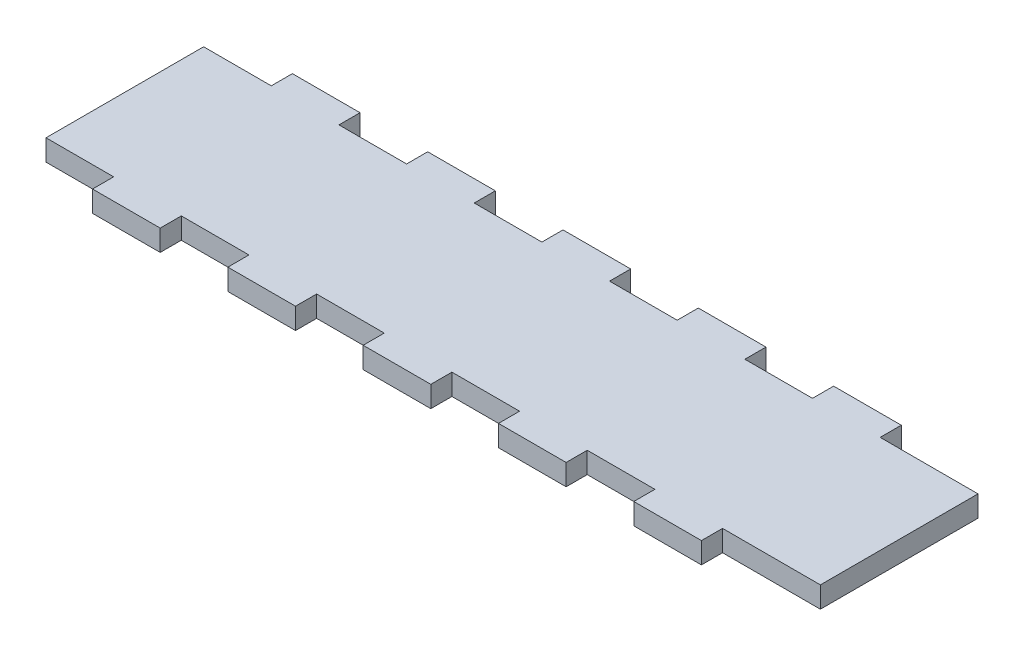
ISO-10303-21;
HEADER;
FILE_DESCRIPTION(('STEP AP214'),'2;1');
FILE_NAME('part.step','',(''),(''),'','','');
FILE_SCHEMA(('AUTOMOTIVE_DESIGN { 1 0 10303 214 1 1 1 1 }'));
ENDSEC;
DATA;
#1=APPLICATION_CONTEXT('core data for automotive mechanical design processes');
#2=APPLICATION_PROTOCOL_DEFINITION('international standard','automotive_design',2000,#1);
#3=PRODUCT_CONTEXT('',#1,'mechanical');
#4=PRODUCT('Part','Part','',(#3));
#5=PRODUCT_RELATED_PRODUCT_CATEGORY('part','',(#4));
#6=PRODUCT_DEFINITION_FORMATION('','',#4);
#7=PRODUCT_DEFINITION_CONTEXT('part definition',#1,'design');
#8=PRODUCT_DEFINITION('design','',#6,#7);
#9=PRODUCT_DEFINITION_SHAPE('','',#8);
#10=(LENGTH_UNIT() NAMED_UNIT(*) SI_UNIT(.MILLI.,.METRE.));
#11=(NAMED_UNIT(*) PLANE_ANGLE_UNIT() SI_UNIT($,.RADIAN.));
#12=(NAMED_UNIT(*) SI_UNIT($,.STERADIAN.) SOLID_ANGLE_UNIT());
#13=UNCERTAINTY_MEASURE_WITH_UNIT(LENGTH_MEASURE(1.E-05),#10,'distance_accuracy_value','');
#14=(GEOMETRIC_REPRESENTATION_CONTEXT(3) GLOBAL_UNCERTAINTY_ASSIGNED_CONTEXT((#13)) GLOBAL_UNIT_ASSIGNED_CONTEXT((#10,
#11,#12)) REPRESENTATION_CONTEXT('',''));
#15=CARTESIAN_POINT('',(0.,0.,0.));
#16=DIRECTION('',(0.,0.,1.));
#17=DIRECTION('',(1.,0.,0.));
#18=AXIS2_PLACEMENT_3D('',#15,#16,#17);
#19=CARTESIAN_POINT('',(59.,3.38,0.));
#20=DIRECTION('',(1.,0.,0.));
#21=DIRECTION('',(0.,0.,-1.));
#22=AXIS2_PLACEMENT_3D('',#19,#20,#21);
#23=PLANE('',#22);
#24=DIRECTION('',(0.,0.,1.));
#25=VECTOR('',#24,1.);
#26=CARTESIAN_POINT('',(59.,0.,0.));
#27=LINE('',#26,#25);
#28=CARTESIAN_POINT('',(59.,0.,-12.62));
#29=VERTEX_POINT('',#28);
#30=CARTESIAN_POINT('',(59.,0.,12.62));
#31=VERTEX_POINT('',#30);
#32=EDGE_CURVE('E348',#29,#31,#27,.T.);
#33=ORIENTED_EDGE('',*,*,#32,.F.);
#34=DIRECTION('',(0.,-1.,0.));
#35=VECTOR('',#34,1.);
#36=CARTESIAN_POINT('',(59.,3.38,-12.62));
#37=LINE('',#36,#35);
#38=CARTESIAN_POINT('',(59.,3.38,-12.62));
#39=VERTEX_POINT('',#38);
#40=EDGE_CURVE('E11',#39,#29,#37,.T.);
#41=ORIENTED_EDGE('',*,*,#40,.F.);
#42=DIRECTION('',(0.,0.,1.));
#43=VECTOR('',#42,1.);
#44=CARTESIAN_POINT('',(59.,3.38,0.));
#45=LINE('',#44,#43);
#46=CARTESIAN_POINT('',(59.,3.38,12.62));
#47=VERTEX_POINT('',#46);
#48=EDGE_CURVE('E444',#39,#47,#45,.T.);
#49=ORIENTED_EDGE('',*,*,#48,.T.);
#50=DIRECTION('',(0.,-1.,0.));
#51=VECTOR('',#50,1.);
#52=CARTESIAN_POINT('',(59.,3.38,12.62));
#53=LINE('',#52,#51);
#54=EDGE_CURVE('E196',#47,#31,#53,.T.);
#55=ORIENTED_EDGE('',*,*,#54,.T.);
#56=EDGE_LOOP('',(#33,#41,#49,#55));
#57=FACE_BOUND('',#56,.T.);
#58=ADVANCED_FACE('F37',(#57),#23,.T.);
#59=CARTESIAN_POINT('',(0.,3.38,-12.62));
#60=DIRECTION('',(0.,0.,-1.));
#61=DIRECTION('',(-1.,0.,0.));
#62=AXIS2_PLACEMENT_3D('',#59,#60,#61);
#63=PLANE('',#62);
#64=DIRECTION('',(1.,0.,0.));
#65=VECTOR('',#64,1.);
#66=CARTESIAN_POINT('',(0.,0.,-12.62));
#67=LINE('',#66,#65);
#68=CARTESIAN_POINT('',(43.3333333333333,0.,-12.62));
#69=VERTEX_POINT('',#68);
#70=EDGE_CURVE('E351',#69,#29,#67,.T.);
#71=ORIENTED_EDGE('',*,*,#70,.F.);
#72=DIRECTION('',(0.,-1.,0.));
#73=VECTOR('',#72,1.);
#74=CARTESIAN_POINT('',(43.3333333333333,3.38,-12.62));
#75=LINE('',#74,#73);
#76=CARTESIAN_POINT('',(43.3333333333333,3.38,-12.62));
#77=VERTEX_POINT('',#76);
#78=EDGE_CURVE('E45',#77,#69,#75,.T.);
#79=ORIENTED_EDGE('',*,*,#78,.F.);
#80=DIRECTION('',(1.,0.,0.));
#81=VECTOR('',#80,1.);
#82=CARTESIAN_POINT('',(0.,3.38,-12.62));
#83=LINE('',#82,#81);
#84=EDGE_CURVE('E563',#77,#39,#83,.T.);
#85=ORIENTED_EDGE('',*,*,#84,.T.);
#86=ORIENTED_EDGE('',*,*,#40,.T.);
#87=EDGE_LOOP('',(#71,#79,#85,#86));
#88=FACE_BOUND('',#87,.T.);
#89=ADVANCED_FACE('F551',(#88),#63,.T.);
#90=CARTESIAN_POINT('',(43.3333333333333,3.38,0.));
#91=DIRECTION('',(1.,0.,0.));
#92=DIRECTION('',(0.,0.,-1.));
#93=AXIS2_PLACEMENT_3D('',#90,#91,#92);
#94=PLANE('',#93);
#95=DIRECTION('',(0.,0.,1.));
#96=VECTOR('',#95,1.);
#97=CARTESIAN_POINT('',(43.3333333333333,0.,0.));
#98=LINE('',#97,#96);
#99=CARTESIAN_POINT('',(43.3333333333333,0.,-16.));
#100=VERTEX_POINT('',#99);
#101=EDGE_CURVE('E354',#100,#69,#98,.T.);
#102=ORIENTED_EDGE('',*,*,#101,.F.);
#103=DIRECTION('',(0.,-1.,0.));
#104=VECTOR('',#103,1.);
#105=CARTESIAN_POINT('',(43.3333333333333,3.38,-16.));
#106=LINE('',#105,#104);
#107=CARTESIAN_POINT('',(43.3333333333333,3.38,-16.));
#108=VERTEX_POINT('',#107);
#109=EDGE_CURVE('E540',#108,#100,#106,.T.);
#110=ORIENTED_EDGE('',*,*,#109,.F.);
#111=DIRECTION('',(0.,0.,1.));
#112=VECTOR('',#111,1.);
#113=CARTESIAN_POINT('',(43.3333333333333,3.38,0.));
#114=LINE('',#113,#112);
#115=EDGE_CURVE('E547',#108,#77,#114,.T.);
#116=ORIENTED_EDGE('',*,*,#115,.T.);
#117=ORIENTED_EDGE('',*,*,#78,.T.);
#118=EDGE_LOOP('',(#102,#110,#116,#117));
#119=FACE_BOUND('',#118,.T.);
#120=ADVANCED_FACE('F545',(#119),#94,.T.);
#121=CARTESIAN_POINT('',(0.,3.38,-16.));
#122=DIRECTION('',(0.,0.,-1.));
#123=DIRECTION('',(-1.,0.,0.));
#124=AXIS2_PLACEMENT_3D('',#121,#122,#123);
#125=PLANE('',#124);
#126=DIRECTION('',(1.,0.,0.));
#127=VECTOR('',#126,1.);
#128=CARTESIAN_POINT('',(0.,0.,-16.));
#129=LINE('',#128,#127);
#130=CARTESIAN_POINT('',(32.5,0.,-16.));
#131=VERTEX_POINT('',#130);
#132=EDGE_CURVE('E357',#131,#100,#129,.T.);
#133=ORIENTED_EDGE('',*,*,#132,.F.);
#134=DIRECTION('',(0.,-1.,0.));
#135=VECTOR('',#134,1.);
#136=CARTESIAN_POINT('',(32.5,3.38,-16.));
#137=LINE('',#136,#135);
#138=CARTESIAN_POINT('',(32.5,3.38,-16.));
#139=VERTEX_POINT('',#138);
#140=EDGE_CURVE('E538',#139,#131,#137,.T.);
#141=ORIENTED_EDGE('',*,*,#140,.F.);
#142=DIRECTION('',(1.,0.,0.));
#143=VECTOR('',#142,1.);
#144=CARTESIAN_POINT('',(0.,3.38,-16.));
#145=LINE('',#144,#143);
#146=EDGE_CURVE('E560',#139,#108,#145,.T.);
#147=ORIENTED_EDGE('',*,*,#146,.T.);
#148=ORIENTED_EDGE('',*,*,#109,.T.);
#149=EDGE_LOOP('',(#133,#141,#147,#148));
#150=FACE_BOUND('',#149,.T.);
#151=ADVANCED_FACE('F557',(#150),#125,.T.);
#152=CARTESIAN_POINT('',(32.5,3.38,0.));
#153=DIRECTION('',(-1.,0.,0.));
#154=DIRECTION('',(0.,0.,1.));
#155=AXIS2_PLACEMENT_3D('',#152,#153,#154);
#156=PLANE('',#155);
#157=DIRECTION('',(0.,0.,-1.));
#158=VECTOR('',#157,1.);
#159=CARTESIAN_POINT('',(32.5,0.,0.));
#160=LINE('',#159,#158);
#161=CARTESIAN_POINT('',(32.5,0.,-12.62));
#162=VERTEX_POINT('',#161);
#163=EDGE_CURVE('E360',#162,#131,#160,.T.);
#164=ORIENTED_EDGE('',*,*,#163,.F.);
#165=DIRECTION('',(0.,-1.,0.));
#166=VECTOR('',#165,1.);
#167=CARTESIAN_POINT('',(32.5,3.38,-12.62));
#168=LINE('',#167,#166);
#169=CARTESIAN_POINT('',(32.5,3.38,-12.62));
#170=VERTEX_POINT('',#169);
#171=EDGE_CURVE('E536',#170,#162,#168,.T.);
#172=ORIENTED_EDGE('',*,*,#171,.F.);
#173=DIRECTION('',(0.,0.,-1.));
#174=VECTOR('',#173,1.);
#175=CARTESIAN_POINT('',(32.5,3.38,0.));
#176=LINE('',#175,#174);
#177=EDGE_CURVE('E565',#170,#139,#176,.T.);
#178=ORIENTED_EDGE('',*,*,#177,.T.);
#179=ORIENTED_EDGE('',*,*,#140,.T.);
#180=EDGE_LOOP('',(#164,#172,#178,#179));
#181=FACE_BOUND('',#180,.T.);
#182=ADVANCED_FACE('F1075',(#181),#156,.T.);
#183=CARTESIAN_POINT('',(0.,3.38,-12.62));
#184=DIRECTION('',(0.,0.,-1.));
#185=DIRECTION('',(-1.,0.,0.));
#186=AXIS2_PLACEMENT_3D('',#183,#184,#185);
#187=PLANE('',#186);
#188=DIRECTION('',(1.,0.,0.));
#189=VECTOR('',#188,1.);
#190=CARTESIAN_POINT('',(0.,0.,-12.62));
#191=LINE('',#190,#189);
#192=CARTESIAN_POINT('',(21.6666666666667,0.,-12.62));
#193=VERTEX_POINT('',#192);
#194=EDGE_CURVE('E365',#193,#162,#191,.T.);
#195=ORIENTED_EDGE('',*,*,#194,.F.);
#196=DIRECTION('',(0.,-1.,0.));
#197=VECTOR('',#196,1.);
#198=CARTESIAN_POINT('',(21.6666666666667,3.38,-12.62));
#199=LINE('',#198,#197);
#200=CARTESIAN_POINT('',(21.6666666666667,3.38,-12.62));
#201=VERTEX_POINT('',#200);
#202=EDGE_CURVE('E534',#201,#193,#199,.T.);
#203=ORIENTED_EDGE('',*,*,#202,.F.);
#204=DIRECTION('',(1.,0.,0.));
#205=VECTOR('',#204,1.);
#206=CARTESIAN_POINT('',(0.,3.38,-12.62));
#207=LINE('',#206,#205);
#208=EDGE_CURVE('E573',#201,#170,#207,.T.);
#209=ORIENTED_EDGE('',*,*,#208,.T.);
#210=ORIENTED_EDGE('',*,*,#171,.T.);
#211=EDGE_LOOP('',(#195,#203,#209,#210));
#212=FACE_BOUND('',#211,.T.);
#213=ADVANCED_FACE('F1065',(#212),#187,.T.);
#214=CARTESIAN_POINT('',(21.6666666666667,3.38,0.));
#215=DIRECTION('',(1.,0.,0.));
#216=DIRECTION('',(0.,0.,-1.));
#217=AXIS2_PLACEMENT_3D('',#214,#215,#216);
#218=PLANE('',#217);
#219=DIRECTION('',(0.,0.,1.));
#220=VECTOR('',#219,1.);
#221=CARTESIAN_POINT('',(21.6666666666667,0.,0.));
#222=LINE('',#221,#220);
#223=CARTESIAN_POINT('',(21.6666666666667,0.,-16.));
#224=VERTEX_POINT('',#223);
#225=EDGE_CURVE('E368',#224,#193,#222,.T.);
#226=ORIENTED_EDGE('',*,*,#225,.F.);
#227=DIRECTION('',(0.,-1.,0.));
#228=VECTOR('',#227,1.);
#229=CARTESIAN_POINT('',(21.6666666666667,3.38,-16.));
#230=LINE('',#229,#228);
#231=CARTESIAN_POINT('',(21.6666666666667,3.38,-16.));
#232=VERTEX_POINT('',#231);
#233=EDGE_CURVE('E532',#232,#224,#230,.T.);
#234=ORIENTED_EDGE('',*,*,#233,.F.);
#235=DIRECTION('',(0.,0.,1.));
#236=VECTOR('',#235,1.);
#237=CARTESIAN_POINT('',(21.6666666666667,3.38,0.));
#238=LINE('',#237,#236);
#239=EDGE_CURVE('E576',#232,#201,#238,.T.);
#240=ORIENTED_EDGE('',*,*,#239,.T.);
#241=ORIENTED_EDGE('',*,*,#202,.T.);
#242=EDGE_LOOP('',(#226,#234,#240,#241));
#243=FACE_BOUND('',#242,.T.);
#244=ADVANCED_FACE('F1056',(#243),#218,.T.);
#245=CARTESIAN_POINT('',(10.8333333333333,0.,-16.));
#246=VERTEX_POINT('',#245);
#247=EDGE_CURVE('E362',#246,#224,#129,.T.);
#248=ORIENTED_EDGE('',*,*,#247,.F.);
#249=DIRECTION('',(0.,-1.,0.));
#250=VECTOR('',#249,1.);
#251=CARTESIAN_POINT('',(10.8333333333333,3.38,-16.));
#252=LINE('',#251,#250);
#253=CARTESIAN_POINT('',(10.8333333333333,3.38,-16.));
#254=VERTEX_POINT('',#253);
#255=EDGE_CURVE('E530',#254,#246,#252,.T.);
#256=ORIENTED_EDGE('',*,*,#255,.F.);
#257=EDGE_CURVE('E568',#254,#232,#145,.T.);
#258=ORIENTED_EDGE('',*,*,#257,.T.);
#259=ORIENTED_EDGE('',*,*,#233,.T.);
#260=EDGE_LOOP('',(#248,#256,#258,#259));
#261=FACE_BOUND('',#260,.T.);
#262=ADVANCED_FACE('F1019',(#261),#125,.T.);
#263=CARTESIAN_POINT('',(10.8333333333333,3.38,0.));
#264=DIRECTION('',(-1.,0.,0.));
#265=DIRECTION('',(0.,0.,1.));
#266=AXIS2_PLACEMENT_3D('',#263,#264,#265);
#267=PLANE('',#266);
#268=DIRECTION('',(0.,0.,-1.));
#269=VECTOR('',#268,1.);
#270=CARTESIAN_POINT('',(10.8333333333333,0.,0.));
#271=LINE('',#270,#269);
#272=CARTESIAN_POINT('',(10.8333333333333,0.,-12.62));
#273=VERTEX_POINT('',#272);
#274=EDGE_CURVE('E371',#273,#246,#271,.T.);
#275=ORIENTED_EDGE('',*,*,#274,.F.);
#276=DIRECTION('',(0.,-1.,0.));
#277=VECTOR('',#276,1.);
#278=CARTESIAN_POINT('',(10.8333333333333,3.38,-12.62));
#279=LINE('',#278,#277);
#280=CARTESIAN_POINT('',(10.8333333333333,3.38,-12.62));
#281=VERTEX_POINT('',#280);
#282=EDGE_CURVE('E528',#281,#273,#279,.T.);
#283=ORIENTED_EDGE('',*,*,#282,.F.);
#284=DIRECTION('',(0.,0.,-1.));
#285=VECTOR('',#284,1.);
#286=CARTESIAN_POINT('',(10.8333333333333,3.38,0.));
#287=LINE('',#286,#285);
#288=EDGE_CURVE('E579',#281,#254,#287,.T.);
#289=ORIENTED_EDGE('',*,*,#288,.T.);
#290=ORIENTED_EDGE('',*,*,#255,.T.);
#291=EDGE_LOOP('',(#275,#283,#289,#290));
#292=FACE_BOUND('',#291,.T.);
#293=ADVANCED_FACE('F1037',(#292),#267,.T.);
#294=CARTESIAN_POINT('',(0.,3.38,-12.62));
#295=DIRECTION('',(0.,0.,-1.));
#296=DIRECTION('',(-1.,0.,0.));
#297=AXIS2_PLACEMENT_3D('',#294,#295,#296);
#298=PLANE('',#297);
#299=DIRECTION('',(1.,0.,0.));
#300=VECTOR('',#299,1.);
#301=CARTESIAN_POINT('',(0.,0.,-12.62));
#302=LINE('',#301,#300);
#303=CARTESIAN_POINT('',(0.,0.,-12.62));
#304=VERTEX_POINT('',#303);
#305=EDGE_CURVE('E374',#304,#273,#302,.T.);
#306=ORIENTED_EDGE('',*,*,#305,.F.);
#307=DIRECTION('',(0.,-1.,0.));
#308=VECTOR('',#307,1.);
#309=CARTESIAN_POINT('',(0.,3.38,-12.62));
#310=LINE('',#309,#308);
#311=CARTESIAN_POINT('',(0.,3.38,-12.62));
#312=VERTEX_POINT('',#311);
#313=EDGE_CURVE('E526',#312,#304,#310,.T.);
#314=ORIENTED_EDGE('',*,*,#313,.F.);
#315=DIRECTION('',(1.,0.,0.));
#316=VECTOR('',#315,1.);
#317=CARTESIAN_POINT('',(0.,3.38,-12.62));
#318=LINE('',#317,#316);
#319=EDGE_CURVE('E582',#312,#281,#318,.T.);
#320=ORIENTED_EDGE('',*,*,#319,.T.);
#321=ORIENTED_EDGE('',*,*,#282,.T.);
#322=EDGE_LOOP('',(#306,#314,#320,#321));
#323=FACE_BOUND('',#322,.T.);
#324=ADVANCED_FACE('F1027',(#323),#298,.T.);
#325=CARTESIAN_POINT('',(0.,3.38,0.));
#326=DIRECTION('',(1.,0.,0.));
#327=DIRECTION('',(0.,0.,-1.));
#328=AXIS2_PLACEMENT_3D('',#325,#326,#327);
#329=PLANE('',#328);
#330=DIRECTION('',(0.,0.,1.));
#331=VECTOR('',#330,1.);
#332=CARTESIAN_POINT('',(0.,0.,0.));
#333=LINE('',#332,#331);
#334=CARTESIAN_POINT('',(0.,0.,-16.));
#335=VERTEX_POINT('',#334);
#336=EDGE_CURVE('E377',#335,#304,#333,.T.);
#337=ORIENTED_EDGE('',*,*,#336,.F.);
#338=DIRECTION('',(0.,-1.,0.));
#339=VECTOR('',#338,1.);
#340=CARTESIAN_POINT('',(0.,3.38,-16.));
#341=LINE('',#340,#339);
#342=CARTESIAN_POINT('',(0.,3.38,-16.));
#343=VERTEX_POINT('',#342);
#344=EDGE_CURVE('E524',#343,#335,#341,.T.);
#345=ORIENTED_EDGE('',*,*,#344,.F.);
#346=DIRECTION('',(0.,0.,1.));
#347=VECTOR('',#346,1.);
#348=CARTESIAN_POINT('',(0.,3.38,0.));
#349=LINE('',#348,#347);
#350=EDGE_CURVE('E585',#343,#312,#349,.T.);
#351=ORIENTED_EDGE('',*,*,#350,.T.);
#352=ORIENTED_EDGE('',*,*,#313,.T.);
#353=EDGE_LOOP('',(#337,#345,#351,#352));
#354=FACE_BOUND('',#353,.T.);
#355=ADVANCED_FACE('F1017',(#354),#329,.T.);
#356=CARTESIAN_POINT('',(-10.8333333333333,0.,-16.));
#357=VERTEX_POINT('',#356);
#358=EDGE_CURVE('E380',#357,#335,#129,.T.);
#359=ORIENTED_EDGE('',*,*,#358,.F.);
#360=DIRECTION('',(0.,-1.,0.));
#361=VECTOR('',#360,1.);
#362=CARTESIAN_POINT('',(-10.8333333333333,3.38,-16.));
#363=LINE('',#362,#361);
#364=CARTESIAN_POINT('',(-10.8333333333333,3.38,-16.));
#365=VERTEX_POINT('',#364);
#366=EDGE_CURVE('E522',#365,#357,#363,.T.);
#367=ORIENTED_EDGE('',*,*,#366,.F.);
#368=EDGE_CURVE('E588',#365,#343,#145,.T.);
#369=ORIENTED_EDGE('',*,*,#368,.T.);
#370=ORIENTED_EDGE('',*,*,#344,.T.);
#371=EDGE_LOOP('',(#359,#367,#369,#370));
#372=FACE_BOUND('',#371,.T.);
#373=ADVANCED_FACE('F980',(#372),#125,.T.);
#374=CARTESIAN_POINT('',(-10.8333333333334,3.38,0.));
#375=DIRECTION('',(-1.,0.,0.));
#376=DIRECTION('',(0.,0.,1.));
#377=AXIS2_PLACEMENT_3D('',#374,#375,#376);
#378=PLANE('',#377);
#379=DIRECTION('',(0.,0.,-1.));
#380=VECTOR('',#379,1.);
#381=CARTESIAN_POINT('',(-10.8333333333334,0.,0.));
#382=LINE('',#381,#380);
#383=CARTESIAN_POINT('',(-10.8333333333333,0.,-12.62));
#384=VERTEX_POINT('',#383);
#385=EDGE_CURVE('E381',#384,#357,#382,.T.);
#386=ORIENTED_EDGE('',*,*,#385,.F.);
#387=DIRECTION('',(0.,-1.,0.));
#388=VECTOR('',#387,1.);
#389=CARTESIAN_POINT('',(-10.8333333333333,3.38,-12.62));
#390=LINE('',#389,#388);
#391=CARTESIAN_POINT('',(-10.8333333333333,3.38,-12.62));
#392=VERTEX_POINT('',#391);
#393=EDGE_CURVE('E520',#392,#384,#390,.T.);
#394=ORIENTED_EDGE('',*,*,#393,.F.);
#395=DIRECTION('',(0.,0.,-1.));
#396=VECTOR('',#395,1.);
#397=CARTESIAN_POINT('',(-10.8333333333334,3.38,0.));
#398=LINE('',#397,#396);
#399=EDGE_CURVE('E589',#392,#365,#398,.T.);
#400=ORIENTED_EDGE('',*,*,#399,.T.);
#401=ORIENTED_EDGE('',*,*,#366,.T.);
#402=EDGE_LOOP('',(#386,#394,#400,#401));
#403=FACE_BOUND('',#402,.T.);
#404=ADVANCED_FACE('F998',(#403),#378,.T.);
#405=CARTESIAN_POINT('',(0.,3.38,-12.62));
#406=DIRECTION('',(0.,0.,-1.));
#407=DIRECTION('',(-1.,0.,0.));
#408=AXIS2_PLACEMENT_3D('',#405,#406,#407);
#409=PLANE('',#408);
#410=DIRECTION('',(1.,0.,0.));
#411=VECTOR('',#410,1.);
#412=CARTESIAN_POINT('',(0.,0.,-12.62));
#413=LINE('',#412,#411);
#414=CARTESIAN_POINT('',(-21.6666666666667,0.,-12.62));
#415=VERTEX_POINT('',#414);
#416=EDGE_CURVE('E384',#415,#384,#413,.T.);
#417=ORIENTED_EDGE('',*,*,#416,.F.);
#418=DIRECTION('',(0.,-1.,0.));
#419=VECTOR('',#418,1.);
#420=CARTESIAN_POINT('',(-21.6666666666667,3.38,-12.62));
#421=LINE('',#420,#419);
#422=CARTESIAN_POINT('',(-21.6666666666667,3.38,-12.62));
#423=VERTEX_POINT('',#422);
#424=EDGE_CURVE('E518',#423,#415,#421,.T.);
#425=ORIENTED_EDGE('',*,*,#424,.F.);
#426=DIRECTION('',(1.,0.,0.));
#427=VECTOR('',#426,1.);
#428=CARTESIAN_POINT('',(0.,3.38,-12.62));
#429=LINE('',#428,#427);
#430=EDGE_CURVE('E592',#423,#392,#429,.T.);
#431=ORIENTED_EDGE('',*,*,#430,.T.);
#432=ORIENTED_EDGE('',*,*,#393,.T.);
#433=EDGE_LOOP('',(#417,#425,#431,#432));
#434=FACE_BOUND('',#433,.T.);
#435=ADVANCED_FACE('F988',(#434),#409,.T.);
#436=CARTESIAN_POINT('',(-21.6666666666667,3.38,0.));
#437=DIRECTION('',(1.,0.,0.));
#438=DIRECTION('',(0.,0.,-1.));
#439=AXIS2_PLACEMENT_3D('',#436,#437,#438);
#440=PLANE('',#439);
#441=DIRECTION('',(0.,0.,1.));
#442=VECTOR('',#441,1.);
#443=CARTESIAN_POINT('',(-21.6666666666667,0.,0.));
#444=LINE('',#443,#442);
#445=CARTESIAN_POINT('',(-21.6666666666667,0.,-16.));
#446=VERTEX_POINT('',#445);
#447=EDGE_CURVE('E387',#446,#415,#444,.T.);
#448=ORIENTED_EDGE('',*,*,#447,.F.);
#449=DIRECTION('',(0.,-1.,0.));
#450=VECTOR('',#449,1.);
#451=CARTESIAN_POINT('',(-21.6666666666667,3.38,-16.));
#452=LINE('',#451,#450);
#453=CARTESIAN_POINT('',(-21.6666666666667,3.38,-16.));
#454=VERTEX_POINT('',#453);
#455=EDGE_CURVE('E516',#454,#446,#452,.T.);
#456=ORIENTED_EDGE('',*,*,#455,.F.);
#457=DIRECTION('',(0.,0.,1.));
#458=VECTOR('',#457,1.);
#459=CARTESIAN_POINT('',(-21.6666666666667,3.38,0.));
#460=LINE('',#459,#458);
#461=EDGE_CURVE('E595',#454,#423,#460,.T.);
#462=ORIENTED_EDGE('',*,*,#461,.T.);
#463=ORIENTED_EDGE('',*,*,#424,.T.);
#464=EDGE_LOOP('',(#448,#456,#462,#463));
#465=FACE_BOUND('',#464,.T.);
#466=ADVANCED_FACE('F978',(#465),#440,.T.);
#467=CARTESIAN_POINT('',(-32.5,0.,-16.));
#468=VERTEX_POINT('',#467);
#469=EDGE_CURVE('E390',#468,#446,#129,.T.);
#470=ORIENTED_EDGE('',*,*,#469,.F.);
#471=DIRECTION('',(0.,-1.,0.));
#472=VECTOR('',#471,1.);
#473=CARTESIAN_POINT('',(-32.5,3.38,-16.));
#474=LINE('',#473,#472);
#475=CARTESIAN_POINT('',(-32.5,3.38,-16.));
#476=VERTEX_POINT('',#475);
#477=EDGE_CURVE('E514',#476,#468,#474,.T.);
#478=ORIENTED_EDGE('',*,*,#477,.F.);
#479=EDGE_CURVE('E598',#476,#454,#145,.T.);
#480=ORIENTED_EDGE('',*,*,#479,.T.);
#481=ORIENTED_EDGE('',*,*,#455,.T.);
#482=EDGE_LOOP('',(#470,#478,#480,#481));
#483=FACE_BOUND('',#482,.T.);
#484=ADVANCED_FACE('F941',(#483),#125,.T.);
#485=CARTESIAN_POINT('',(-32.5,3.38,0.));
#486=DIRECTION('',(-1.,0.,0.));
#487=DIRECTION('',(0.,0.,1.));
#488=AXIS2_PLACEMENT_3D('',#485,#486,#487);
#489=PLANE('',#488);
#490=DIRECTION('',(0.,0.,-1.));
#491=VECTOR('',#490,1.);
#492=CARTESIAN_POINT('',(-32.5,0.,0.));
#493=LINE('',#492,#491);
#494=CARTESIAN_POINT('',(-32.5,0.,-12.62));
#495=VERTEX_POINT('',#494);
#496=EDGE_CURVE('E391',#495,#468,#493,.T.);
#497=ORIENTED_EDGE('',*,*,#496,.F.);
#498=DIRECTION('',(0.,-1.,0.));
#499=VECTOR('',#498,1.);
#500=CARTESIAN_POINT('',(-32.5,3.38,-12.62));
#501=LINE('',#500,#499);
#502=CARTESIAN_POINT('',(-32.5,3.38,-12.62));
#503=VERTEX_POINT('',#502);
#504=EDGE_CURVE('E512',#503,#495,#501,.T.);
#505=ORIENTED_EDGE('',*,*,#504,.F.);
#506=DIRECTION('',(0.,0.,-1.));
#507=VECTOR('',#506,1.);
#508=CARTESIAN_POINT('',(-32.5,3.38,0.));
#509=LINE('',#508,#507);
#510=EDGE_CURVE('E599',#503,#476,#509,.T.);
#511=ORIENTED_EDGE('',*,*,#510,.T.);
#512=ORIENTED_EDGE('',*,*,#477,.T.);
#513=EDGE_LOOP('',(#497,#505,#511,#512));
#514=FACE_BOUND('',#513,.T.);
#515=ADVANCED_FACE('F959',(#514),#489,.T.);
#516=CARTESIAN_POINT('',(0.,3.38,-12.62));
#517=DIRECTION('',(0.,0.,-1.));
#518=DIRECTION('',(-1.,0.,0.));
#519=AXIS2_PLACEMENT_3D('',#516,#517,#518);
#520=PLANE('',#519);
#521=DIRECTION('',(1.,0.,0.));
#522=VECTOR('',#521,1.);
#523=CARTESIAN_POINT('',(0.,0.,-12.62));
#524=LINE('',#523,#522);
#525=CARTESIAN_POINT('',(-43.3333333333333,0.,-12.62));
#526=VERTEX_POINT('',#525);
#527=EDGE_CURVE('E394',#526,#495,#524,.T.);
#528=ORIENTED_EDGE('',*,*,#527,.F.);
#529=DIRECTION('',(0.,-1.,0.));
#530=VECTOR('',#529,1.);
#531=CARTESIAN_POINT('',(-43.3333333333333,3.38,-12.62));
#532=LINE('',#531,#530);
#533=CARTESIAN_POINT('',(-43.3333333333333,3.38,-12.62));
#534=VERTEX_POINT('',#533);
#535=EDGE_CURVE('E510',#534,#526,#532,.T.);
#536=ORIENTED_EDGE('',*,*,#535,.F.);
#537=DIRECTION('',(1.,0.,0.));
#538=VECTOR('',#537,1.);
#539=CARTESIAN_POINT('',(0.,3.38,-12.62));
#540=LINE('',#539,#538);
#541=EDGE_CURVE('E602',#534,#503,#540,.T.);
#542=ORIENTED_EDGE('',*,*,#541,.T.);
#543=ORIENTED_EDGE('',*,*,#504,.T.);
#544=EDGE_LOOP('',(#528,#536,#542,#543));
#545=FACE_BOUND('',#544,.T.);
#546=ADVANCED_FACE('F949',(#545),#520,.T.);
#547=CARTESIAN_POINT('',(-43.3333333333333,3.38,0.));
#548=DIRECTION('',(1.,0.,0.));
#549=DIRECTION('',(0.,0.,-1.));
#550=AXIS2_PLACEMENT_3D('',#547,#548,#549);
#551=PLANE('',#550);
#552=DIRECTION('',(0.,0.,1.));
#553=VECTOR('',#552,1.);
#554=CARTESIAN_POINT('',(-43.3333333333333,0.,0.));
#555=LINE('',#554,#553);
#556=CARTESIAN_POINT('',(-43.3333333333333,0.,-16.));
#557=VERTEX_POINT('',#556);
#558=EDGE_CURVE('E397',#557,#526,#555,.T.);
#559=ORIENTED_EDGE('',*,*,#558,.F.);
#560=DIRECTION('',(0.,-1.,0.));
#561=VECTOR('',#560,1.);
#562=CARTESIAN_POINT('',(-43.3333333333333,3.38,-16.));
#563=LINE('',#562,#561);
#564=CARTESIAN_POINT('',(-43.3333333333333,3.38,-16.));
#565=VERTEX_POINT('',#564);
#566=EDGE_CURVE('E508',#565,#557,#563,.T.);
#567=ORIENTED_EDGE('',*,*,#566,.F.);
#568=DIRECTION('',(0.,0.,1.));
#569=VECTOR('',#568,1.);
#570=CARTESIAN_POINT('',(-43.3333333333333,3.38,0.));
#571=LINE('',#570,#569);
#572=EDGE_CURVE('E605',#565,#534,#571,.T.);
#573=ORIENTED_EDGE('',*,*,#572,.T.);
#574=ORIENTED_EDGE('',*,*,#535,.T.);
#575=EDGE_LOOP('',(#559,#567,#573,#574));
#576=FACE_BOUND('',#575,.T.);
#577=ADVANCED_FACE('F938',(#576),#551,.T.);
#578=CARTESIAN_POINT('',(-54.1666666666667,0.,-16.));
#579=VERTEX_POINT('',#578);
#580=EDGE_CURVE('E361',#579,#557,#129,.T.);
#581=ORIENTED_EDGE('',*,*,#580,.F.);
#582=DIRECTION('',(0.,-1.,0.));
#583=VECTOR('',#582,1.);
#584=CARTESIAN_POINT('',(-54.1666666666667,3.38,-16.));
#585=LINE('',#584,#583);
#586=CARTESIAN_POINT('',(-54.1666666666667,3.38,-16.));
#587=VERTEX_POINT('',#586);
#588=EDGE_CURVE('E506',#587,#579,#585,.T.);
#589=ORIENTED_EDGE('',*,*,#588,.F.);
#590=EDGE_CURVE('E567',#587,#565,#145,.T.);
#591=ORIENTED_EDGE('',*,*,#590,.T.);
#592=ORIENTED_EDGE('',*,*,#566,.T.);
#593=EDGE_LOOP('',(#581,#589,#591,#592));
#594=FACE_BOUND('',#593,.T.);
#595=ADVANCED_FACE('F928',(#594),#125,.T.);
#596=CARTESIAN_POINT('',(-54.1666666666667,3.38,0.));
#597=DIRECTION('',(-1.,0.,0.));
#598=DIRECTION('',(0.,0.,1.));
#599=AXIS2_PLACEMENT_3D('',#596,#597,#598);
#600=PLANE('',#599);
#601=DIRECTION('',(0.,0.,-1.));
#602=VECTOR('',#601,1.);
#603=CARTESIAN_POINT('',(-54.1666666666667,0.,0.));
#604=LINE('',#603,#602);
#605=CARTESIAN_POINT('',(-54.1666666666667,0.,-12.62));
#606=VERTEX_POINT('',#605);
#607=EDGE_CURVE('E400',#606,#579,#604,.T.);
#608=ORIENTED_EDGE('',*,*,#607,.F.);
#609=DIRECTION('',(0.,-1.,0.));
#610=VECTOR('',#609,1.);
#611=CARTESIAN_POINT('',(-54.1666666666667,3.38,-12.62));
#612=LINE('',#611,#610);
#613=CARTESIAN_POINT('',(-54.1666666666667,3.38,-12.62));
#614=VERTEX_POINT('',#613);
#615=EDGE_CURVE('E504',#614,#606,#612,.T.);
#616=ORIENTED_EDGE('',*,*,#615,.F.);
#617=DIRECTION('',(0.,0.,-1.));
#618=VECTOR('',#617,1.);
#619=CARTESIAN_POINT('',(-54.1666666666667,3.38,0.));
#620=LINE('',#619,#618);
#621=EDGE_CURVE('E608',#614,#587,#620,.T.);
#622=ORIENTED_EDGE('',*,*,#621,.T.);
#623=ORIENTED_EDGE('',*,*,#588,.T.);
#624=EDGE_LOOP('',(#608,#616,#622,#623));
#625=FACE_BOUND('',#624,.T.);
#626=ADVANCED_FACE('F918',(#625),#600,.T.);
#627=CARTESIAN_POINT('',(0.,3.38,-12.62));
#628=DIRECTION('',(0.,0.,-1.));
#629=DIRECTION('',(-1.,0.,0.));
#630=AXIS2_PLACEMENT_3D('',#627,#628,#629);
#631=PLANE('',#630);
#632=DIRECTION('',(1.,0.,0.));
#633=VECTOR('',#632,1.);
#634=CARTESIAN_POINT('',(0.,0.,-12.62));
#635=LINE('',#634,#633);
#636=CARTESIAN_POINT('',(-65.,0.,-12.62));
#637=VERTEX_POINT('',#636);
#638=EDGE_CURVE('E403',#637,#606,#635,.T.);
#639=ORIENTED_EDGE('',*,*,#638,.F.);
#640=DIRECTION('',(0.,-1.,0.));
#641=VECTOR('',#640,1.);
#642=CARTESIAN_POINT('',(-65.,3.38,-12.62));
#643=LINE('',#642,#641);
#644=CARTESIAN_POINT('',(-65.,3.38,-12.62));
#645=VERTEX_POINT('',#644);
#646=EDGE_CURVE('E502',#645,#637,#643,.T.);
#647=ORIENTED_EDGE('',*,*,#646,.F.);
#648=DIRECTION('',(1.,0.,0.));
#649=VECTOR('',#648,1.);
#650=CARTESIAN_POINT('',(0.,3.38,-12.62));
#651=LINE('',#650,#649);
#652=EDGE_CURVE('E611',#645,#614,#651,.T.);
#653=ORIENTED_EDGE('',*,*,#652,.T.);
#654=ORIENTED_EDGE('',*,*,#615,.T.);
#655=EDGE_LOOP('',(#639,#647,#653,#654));
#656=FACE_BOUND('',#655,.T.);
#657=ADVANCED_FACE('F908',(#656),#631,.T.);
#658=CARTESIAN_POINT('',(-65.,3.38,0.));
#659=DIRECTION('',(1.,0.,0.));
#660=DIRECTION('',(0.,0.,-1.));
#661=AXIS2_PLACEMENT_3D('',#658,#659,#660);
#662=PLANE('',#661);
#663=DIRECTION('',(0.,0.,1.));
#664=VECTOR('',#663,1.);
#665=CARTESIAN_POINT('',(-65.,0.,0.));
#666=LINE('',#665,#664);
#667=CARTESIAN_POINT('',(-65.,0.,12.62));
#668=VERTEX_POINT('',#667);
#669=EDGE_CURVE('E406',#637,#668,#666,.T.);
#670=ORIENTED_EDGE('',*,*,#669,.T.);
#671=DIRECTION('',(0.,-1.,0.));
#672=VECTOR('',#671,1.);
#673=CARTESIAN_POINT('',(-65.,3.38,12.62));
#674=LINE('',#673,#672);
#675=CARTESIAN_POINT('',(-65.,3.38,12.62));
#676=VERTEX_POINT('',#675);
#677=EDGE_CURVE('E499',#676,#668,#674,.T.);
#678=ORIENTED_EDGE('',*,*,#677,.F.);
#679=DIRECTION('',(0.,0.,1.));
#680=VECTOR('',#679,1.);
#681=CARTESIAN_POINT('',(-65.,3.38,0.));
#682=LINE('',#681,#680);
#683=EDGE_CURVE('E614',#645,#676,#682,.T.);
#684=ORIENTED_EDGE('',*,*,#683,.F.);
#685=ORIENTED_EDGE('',*,*,#646,.T.);
#686=EDGE_LOOP('',(#670,#678,#684,#685));
#687=FACE_BOUND('',#686,.T.);
#688=ADVANCED_FACE('F898',(#687),#662,.F.);
#689=CARTESIAN_POINT('',(0.,3.38,12.62));
#690=DIRECTION('',(0.,0.,-1.));
#691=DIRECTION('',(-1.,0.,0.));
#692=AXIS2_PLACEMENT_3D('',#689,#690,#691);
#693=PLANE('',#692);
#694=DIRECTION('',(1.,0.,0.));
#695=VECTOR('',#694,1.);
#696=CARTESIAN_POINT('',(0.,0.,12.62));
#697=LINE('',#696,#695);
#698=CARTESIAN_POINT('',(-54.1666666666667,0.,12.62));
#699=VERTEX_POINT('',#698);
#700=EDGE_CURVE('E408',#668,#699,#697,.T.);
#701=ORIENTED_EDGE('',*,*,#700,.T.);
#702=DIRECTION('',(0.,-1.,0.));
#703=VECTOR('',#702,1.);
#704=CARTESIAN_POINT('',(-54.1666666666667,3.38,12.62));
#705=LINE('',#704,#703);
#706=CARTESIAN_POINT('',(-54.1666666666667,3.38,12.62));
#707=VERTEX_POINT('',#706);
#708=EDGE_CURVE('E496',#707,#699,#705,.T.);
#709=ORIENTED_EDGE('',*,*,#708,.F.);
#710=DIRECTION('',(1.,0.,0.));
#711=VECTOR('',#710,1.);
#712=CARTESIAN_POINT('',(0.,3.38,12.62));
#713=LINE('',#712,#711);
#714=EDGE_CURVE('E616',#676,#707,#713,.T.);
#715=ORIENTED_EDGE('',*,*,#714,.F.);
#716=ORIENTED_EDGE('',*,*,#677,.T.);
#717=EDGE_LOOP('',(#701,#709,#715,#716));
#718=FACE_BOUND('',#717,.T.);
#719=ADVANCED_FACE('F888',(#718),#693,.F.);
#720=CARTESIAN_POINT('',(-54.1666666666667,3.38,0.));
#721=DIRECTION('',(1.,0.,0.));
#722=DIRECTION('',(0.,0.,-1.));
#723=AXIS2_PLACEMENT_3D('',#720,#721,#722);
#724=PLANE('',#723);
#725=DIRECTION('',(0.,0.,1.));
#726=VECTOR('',#725,1.);
#727=CARTESIAN_POINT('',(-54.1666666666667,0.,0.));
#728=LINE('',#727,#726);
#729=CARTESIAN_POINT('',(-54.1666666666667,0.,16.));
#730=VERTEX_POINT('',#729);
#731=EDGE_CURVE('E410',#699,#730,#728,.T.);
#732=ORIENTED_EDGE('',*,*,#731,.T.);
#733=DIRECTION('',(0.,-1.,0.));
#734=VECTOR('',#733,1.);
#735=CARTESIAN_POINT('',(-54.1666666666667,3.38,16.));
#736=LINE('',#735,#734);
#737=CARTESIAN_POINT('',(-54.1666666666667,3.38,16.));
#738=VERTEX_POINT('',#737);
#739=EDGE_CURVE('E493',#738,#730,#736,.T.);
#740=ORIENTED_EDGE('',*,*,#739,.F.);
#741=DIRECTION('',(0.,0.,1.));
#742=VECTOR('',#741,1.);
#743=CARTESIAN_POINT('',(-54.1666666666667,3.38,0.));
#744=LINE('',#743,#742);
#745=EDGE_CURVE('E618',#707,#738,#744,.T.);
#746=ORIENTED_EDGE('',*,*,#745,.F.);
#747=ORIENTED_EDGE('',*,*,#708,.T.);
#748=EDGE_LOOP('',(#732,#740,#746,#747));
#749=FACE_BOUND('',#748,.T.);
#750=ADVANCED_FACE('F879',(#749),#724,.F.);
#751=CARTESIAN_POINT('',(0.,3.38,16.));
#752=DIRECTION('',(0.,0.,-1.));
#753=DIRECTION('',(-1.,0.,0.));
#754=AXIS2_PLACEMENT_3D('',#751,#752,#753);
#755=PLANE('',#754);
#756=DIRECTION('',(1.,0.,0.));
#757=VECTOR('',#756,1.);
#758=CARTESIAN_POINT('',(0.,0.,16.));
#759=LINE('',#758,#757);
#760=CARTESIAN_POINT('',(-43.3333333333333,0.,16.));
#761=VERTEX_POINT('',#760);
#762=EDGE_CURVE('E412',#730,#761,#759,.T.);
#763=ORIENTED_EDGE('',*,*,#762,.T.);
#764=DIRECTION('',(0.,-1.,0.));
#765=VECTOR('',#764,1.);
#766=CARTESIAN_POINT('',(-43.3333333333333,3.38,16.));
#767=LINE('',#766,#765);
#768=CARTESIAN_POINT('',(-43.3333333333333,3.38,16.));
#769=VERTEX_POINT('',#768);
#770=EDGE_CURVE('E490',#769,#761,#767,.T.);
#771=ORIENTED_EDGE('',*,*,#770,.F.);
#772=DIRECTION('',(1.,0.,0.));
#773=VECTOR('',#772,1.);
#774=CARTESIAN_POINT('',(0.,3.38,16.));
#775=LINE('',#774,#773);
#776=EDGE_CURVE('E334',#738,#769,#775,.T.);
#777=ORIENTED_EDGE('',*,*,#776,.F.);
#778=ORIENTED_EDGE('',*,*,#739,.T.);
#779=EDGE_LOOP('',(#763,#771,#777,#778));
#780=FACE_BOUND('',#779,.T.);
#781=ADVANCED_FACE('F717',(#780),#755,.F.);
#782=CARTESIAN_POINT('',(-43.3333333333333,3.38,0.));
#783=DIRECTION('',(-1.,0.,0.));
#784=DIRECTION('',(0.,0.,1.));
#785=AXIS2_PLACEMENT_3D('',#782,#783,#784);
#786=PLANE('',#785);
#787=DIRECTION('',(0.,0.,-1.));
#788=VECTOR('',#787,1.);
#789=CARTESIAN_POINT('',(-43.3333333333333,0.,0.));
#790=LINE('',#789,#788);
#791=CARTESIAN_POINT('',(-43.3333333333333,0.,12.62));
#792=VERTEX_POINT('',#791);
#793=EDGE_CURVE('E414',#761,#792,#790,.T.);
#794=ORIENTED_EDGE('',*,*,#793,.T.);
#795=DIRECTION('',(0.,-1.,0.));
#796=VECTOR('',#795,1.);
#797=CARTESIAN_POINT('',(-43.3333333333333,3.38,12.62));
#798=LINE('',#797,#796);
#799=CARTESIAN_POINT('',(-43.3333333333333,3.38,12.62));
#800=VERTEX_POINT('',#799);
#801=EDGE_CURVE('E487',#800,#792,#798,.T.);
#802=ORIENTED_EDGE('',*,*,#801,.F.);
#803=DIRECTION('',(0.,0.,-1.));
#804=VECTOR('',#803,1.);
#805=CARTESIAN_POINT('',(-43.3333333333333,3.38,0.));
#806=LINE('',#805,#804);
#807=EDGE_CURVE('E620',#769,#800,#806,.T.);
#808=ORIENTED_EDGE('',*,*,#807,.F.);
#809=ORIENTED_EDGE('',*,*,#770,.T.);
#810=EDGE_LOOP('',(#794,#802,#808,#809));
#811=FACE_BOUND('',#810,.T.);
#812=ADVANCED_FACE('F860',(#811),#786,.F.);
#813=CARTESIAN_POINT('',(0.,3.38,12.62));
#814=DIRECTION('',(0.,0.,-1.));
#815=DIRECTION('',(-1.,0.,0.));
#816=AXIS2_PLACEMENT_3D('',#813,#814,#815);
#817=PLANE('',#816);
#818=DIRECTION('',(1.,0.,0.));
#819=VECTOR('',#818,1.);
#820=CARTESIAN_POINT('',(0.,0.,12.62));
#821=LINE('',#820,#819);
#822=CARTESIAN_POINT('',(-32.5,0.,12.62));
#823=VERTEX_POINT('',#822);
#824=EDGE_CURVE('E417',#792,#823,#821,.T.);
#825=ORIENTED_EDGE('',*,*,#824,.T.);
#826=DIRECTION('',(0.,-1.,0.));
#827=VECTOR('',#826,1.);
#828=CARTESIAN_POINT('',(-32.5,3.38,12.62));
#829=LINE('',#828,#827);
#830=CARTESIAN_POINT('',(-32.5,3.38,12.62));
#831=VERTEX_POINT('',#830);
#832=EDGE_CURVE('E484',#831,#823,#829,.T.);
#833=ORIENTED_EDGE('',*,*,#832,.F.);
#834=DIRECTION('',(1.,0.,0.));
#835=VECTOR('',#834,1.);
#836=CARTESIAN_POINT('',(0.,3.38,12.62));
#837=LINE('',#836,#835);
#838=EDGE_CURVE('E623',#800,#831,#837,.T.);
#839=ORIENTED_EDGE('',*,*,#838,.F.);
#840=ORIENTED_EDGE('',*,*,#801,.T.);
#841=EDGE_LOOP('',(#825,#833,#839,#840));
#842=FACE_BOUND('',#841,.T.);
#843=ADVANCED_FACE('F850',(#842),#817,.F.);
#844=CARTESIAN_POINT('',(-32.5,3.38,0.));
#845=DIRECTION('',(1.,0.,0.));
#846=DIRECTION('',(0.,0.,-1.));
#847=AXIS2_PLACEMENT_3D('',#844,#845,#846);
#848=PLANE('',#847);
#849=DIRECTION('',(0.,0.,1.));
#850=VECTOR('',#849,1.);
#851=CARTESIAN_POINT('',(-32.5,0.,0.));
#852=LINE('',#851,#850);
#853=CARTESIAN_POINT('',(-32.5,0.,16.));
#854=VERTEX_POINT('',#853);
#855=EDGE_CURVE('E419',#823,#854,#852,.T.);
#856=ORIENTED_EDGE('',*,*,#855,.T.);
#857=DIRECTION('',(0.,-1.,0.));
#858=VECTOR('',#857,1.);
#859=CARTESIAN_POINT('',(-32.5,3.38,16.));
#860=LINE('',#859,#858);
#861=CARTESIAN_POINT('',(-32.5,3.38,16.));
#862=VERTEX_POINT('',#861);
#863=EDGE_CURVE('E481',#862,#854,#860,.T.);
#864=ORIENTED_EDGE('',*,*,#863,.F.);
#865=DIRECTION('',(0.,0.,1.));
#866=VECTOR('',#865,1.);
#867=CARTESIAN_POINT('',(-32.5,3.38,0.));
#868=LINE('',#867,#866);
#869=EDGE_CURVE('E625',#831,#862,#868,.T.);
#870=ORIENTED_EDGE('',*,*,#869,.F.);
#871=ORIENTED_EDGE('',*,*,#832,.T.);
#872=EDGE_LOOP('',(#856,#864,#870,#871));
#873=FACE_BOUND('',#872,.T.);
#874=ADVANCED_FACE('F716',(#873),#848,.F.);
#875=CARTESIAN_POINT('',(-21.6666666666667,0.,16.));
#876=VERTEX_POINT('',#875);
#877=EDGE_CURVE('E415',#854,#876,#759,.T.);
#878=ORIENTED_EDGE('',*,*,#877,.T.);
#879=DIRECTION('',(0.,-1.,0.));
#880=VECTOR('',#879,1.);
#881=CARTESIAN_POINT('',(-21.6666666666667,3.38,16.));
#882=LINE('',#881,#880);
#883=CARTESIAN_POINT('',(-21.6666666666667,3.38,16.));
#884=VERTEX_POINT('',#883);
#885=EDGE_CURVE('E478',#884,#876,#882,.T.);
#886=ORIENTED_EDGE('',*,*,#885,.F.);
#887=EDGE_CURVE('E621',#862,#884,#775,.T.);
#888=ORIENTED_EDGE('',*,*,#887,.F.);
#889=ORIENTED_EDGE('',*,*,#863,.T.);
#890=EDGE_LOOP('',(#878,#886,#888,#889));
#891=FACE_BOUND('',#890,.T.);
#892=ADVANCED_FACE('F662',(#891),#755,.F.);
#893=CARTESIAN_POINT('',(-21.6666666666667,3.38,0.));
#894=DIRECTION('',(-1.,0.,0.));
#895=DIRECTION('',(0.,0.,1.));
#896=AXIS2_PLACEMENT_3D('',#893,#894,#895);
#897=PLANE('',#896);
#898=DIRECTION('',(0.,0.,-1.));
#899=VECTOR('',#898,1.);
#900=CARTESIAN_POINT('',(-21.6666666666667,0.,0.));
#901=LINE('',#900,#899);
#902=CARTESIAN_POINT('',(-21.6666666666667,0.,12.62));
#903=VERTEX_POINT('',#902);
#904=EDGE_CURVE('E421',#876,#903,#901,.T.);
#905=ORIENTED_EDGE('',*,*,#904,.T.);
#906=DIRECTION('',(0.,-1.,0.));
#907=VECTOR('',#906,1.);
#908=CARTESIAN_POINT('',(-21.6666666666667,3.38,12.62));
#909=LINE('',#908,#907);
#910=CARTESIAN_POINT('',(-21.6666666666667,3.38,12.62));
#911=VERTEX_POINT('',#910);
#912=EDGE_CURVE('E475',#911,#903,#909,.T.);
#913=ORIENTED_EDGE('',*,*,#912,.F.);
#914=DIRECTION('',(0.,0.,-1.));
#915=VECTOR('',#914,1.);
#916=CARTESIAN_POINT('',(-21.6666666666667,3.38,0.));
#917=LINE('',#916,#915);
#918=EDGE_CURVE('E627',#884,#911,#917,.T.);
#919=ORIENTED_EDGE('',*,*,#918,.F.);
#920=ORIENTED_EDGE('',*,*,#885,.T.);
#921=EDGE_LOOP('',(#905,#913,#919,#920));
#922=FACE_BOUND('',#921,.T.);
#923=ADVANCED_FACE('F669',(#922),#897,.F.);
#924=CARTESIAN_POINT('',(0.,3.38,12.62));
#925=DIRECTION('',(0.,0.,-1.));
#926=DIRECTION('',(-1.,0.,0.));
#927=AXIS2_PLACEMENT_3D('',#924,#925,#926);
#928=PLANE('',#927);
#929=DIRECTION('',(1.,0.,0.));
#930=VECTOR('',#929,1.);
#931=CARTESIAN_POINT('',(0.,0.,12.62));
#932=LINE('',#931,#930);
#933=CARTESIAN_POINT('',(-10.8333333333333,0.,12.62));
#934=VERTEX_POINT('',#933);
#935=EDGE_CURVE('E423',#903,#934,#932,.T.);
#936=ORIENTED_EDGE('',*,*,#935,.T.);
#937=DIRECTION('',(0.,-1.,0.));
#938=VECTOR('',#937,1.);
#939=CARTESIAN_POINT('',(-10.8333333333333,3.38,12.62));
#940=LINE('',#939,#938);
#941=CARTESIAN_POINT('',(-10.8333333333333,3.38,12.62));
#942=VERTEX_POINT('',#941);
#943=EDGE_CURVE('E472',#942,#934,#940,.T.);
#944=ORIENTED_EDGE('',*,*,#943,.F.);
#945=DIRECTION('',(1.,0.,0.));
#946=VECTOR('',#945,1.);
#947=CARTESIAN_POINT('',(0.,3.38,12.62));
#948=LINE('',#947,#946);
#949=EDGE_CURVE('E629',#911,#942,#948,.T.);
#950=ORIENTED_EDGE('',*,*,#949,.F.);
#951=ORIENTED_EDGE('',*,*,#912,.T.);
#952=EDGE_LOOP('',(#936,#944,#950,#951));
#953=FACE_BOUND('',#952,.T.);
#954=ADVANCED_FACE('F675',(#953),#928,.F.);
#955=CARTESIAN_POINT('',(-10.8333333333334,3.38,0.));
#956=DIRECTION('',(1.,0.,0.));
#957=DIRECTION('',(0.,0.,-1.));
#958=AXIS2_PLACEMENT_3D('',#955,#956,#957);
#959=PLANE('',#958);
#960=DIRECTION('',(0.,0.,1.));
#961=VECTOR('',#960,1.);
#962=CARTESIAN_POINT('',(-10.8333333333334,0.,0.));
#963=LINE('',#962,#961);
#964=CARTESIAN_POINT('',(-10.8333333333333,0.,16.));
#965=VERTEX_POINT('',#964);
#966=EDGE_CURVE('E425',#934,#965,#963,.T.);
#967=ORIENTED_EDGE('',*,*,#966,.T.);
#968=DIRECTION('',(0.,-1.,0.));
#969=VECTOR('',#968,1.);
#970=CARTESIAN_POINT('',(-10.8333333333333,3.38,16.));
#971=LINE('',#970,#969);
#972=CARTESIAN_POINT('',(-10.8333333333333,3.38,16.));
#973=VERTEX_POINT('',#972);
#974=EDGE_CURVE('E469',#973,#965,#971,.T.);
#975=ORIENTED_EDGE('',*,*,#974,.F.);
#976=DIRECTION('',(0.,0.,1.));
#977=VECTOR('',#976,1.);
#978=CARTESIAN_POINT('',(-10.8333333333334,3.38,0.));
#979=LINE('',#978,#977);
#980=EDGE_CURVE('E631',#942,#973,#979,.T.);
#981=ORIENTED_EDGE('',*,*,#980,.F.);
#982=ORIENTED_EDGE('',*,*,#943,.T.);
#983=EDGE_LOOP('',(#967,#975,#981,#982));
#984=FACE_BOUND('',#983,.T.);
#985=ADVANCED_FACE('F679',(#984),#959,.F.);
#986=CARTESIAN_POINT('',(0.,0.,16.));
#987=VERTEX_POINT('',#986);
#988=EDGE_CURVE('E427',#965,#987,#759,.T.);
#989=ORIENTED_EDGE('',*,*,#988,.T.);
#990=DIRECTION('',(0.,-1.,0.));
#991=VECTOR('',#990,1.);
#992=CARTESIAN_POINT('',(0.,3.38,16.));
#993=LINE('',#992,#991);
#994=CARTESIAN_POINT('',(0.,3.38,16.));
#995=VERTEX_POINT('',#994);
#996=EDGE_CURVE('E466',#995,#987,#993,.T.);
#997=ORIENTED_EDGE('',*,*,#996,.F.);
#998=EDGE_CURVE('E633',#973,#995,#775,.T.);
#999=ORIENTED_EDGE('',*,*,#998,.F.);
#1000=ORIENTED_EDGE('',*,*,#974,.T.);
#1001=EDGE_LOOP('',(#989,#997,#999,#1000));
#1002=FACE_BOUND('',#1001,.T.);
#1003=ADVANCED_FACE('F703',(#1002),#755,.F.);
#1004=CARTESIAN_POINT('',(0.,3.38,0.));
#1005=DIRECTION('',(-1.,0.,0.));
#1006=DIRECTION('',(0.,0.,1.));
#1007=AXIS2_PLACEMENT_3D('',#1004,#1005,#1006);
#1008=PLANE('',#1007);
#1009=DIRECTION('',(0.,0.,-1.));
#1010=VECTOR('',#1009,1.);
#1011=CARTESIAN_POINT('',(0.,0.,0.));
#1012=LINE('',#1011,#1010);
#1013=CARTESIAN_POINT('',(0.,0.,12.62));
#1014=VERTEX_POINT('',#1013);
#1015=EDGE_CURVE('E428',#987,#1014,#1012,.T.);
#1016=ORIENTED_EDGE('',*,*,#1015,.T.);
#1017=DIRECTION('',(0.,-1.,0.));
#1018=VECTOR('',#1017,1.);
#1019=CARTESIAN_POINT('',(0.,3.38,12.62));
#1020=LINE('',#1019,#1018);
#1021=CARTESIAN_POINT('',(0.,3.38,12.62));
#1022=VERTEX_POINT('',#1021);
#1023=EDGE_CURVE('E463',#1022,#1014,#1020,.T.);
#1024=ORIENTED_EDGE('',*,*,#1023,.F.);
#1025=DIRECTION('',(0.,0.,-1.));
#1026=VECTOR('',#1025,1.);
#1027=CARTESIAN_POINT('',(0.,3.38,0.));
#1028=LINE('',#1027,#1026);
#1029=EDGE_CURVE('E634',#995,#1022,#1028,.T.);
#1030=ORIENTED_EDGE('',*,*,#1029,.F.);
#1031=ORIENTED_EDGE('',*,*,#996,.T.);
#1032=EDGE_LOOP('',(#1016,#1024,#1030,#1031));
#1033=FACE_BOUND('',#1032,.T.);
#1034=ADVANCED_FACE('F702',(#1033),#1008,.F.);
#1035=CARTESIAN_POINT('',(0.,3.38,12.62));
#1036=DIRECTION('',(0.,0.,-1.));
#1037=DIRECTION('',(-1.,0.,0.));
#1038=AXIS2_PLACEMENT_3D('',#1035,#1036,#1037);
#1039=PLANE('',#1038);
#1040=DIRECTION('',(1.,0.,0.));
#1041=VECTOR('',#1040,1.);
#1042=CARTESIAN_POINT('',(0.,0.,12.62));
#1043=LINE('',#1042,#1041);
#1044=CARTESIAN_POINT('',(10.8333333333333,0.,12.62));
#1045=VERTEX_POINT('',#1044);
#1046=EDGE_CURVE('E430',#1014,#1045,#1043,.T.);
#1047=ORIENTED_EDGE('',*,*,#1046,.T.);
#1048=DIRECTION('',(0.,-1.,0.));
#1049=VECTOR('',#1048,1.);
#1050=CARTESIAN_POINT('',(10.8333333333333,3.38,12.62));
#1051=LINE('',#1050,#1049);
#1052=CARTESIAN_POINT('',(10.8333333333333,3.38,12.62));
#1053=VERTEX_POINT('',#1052);
#1054=EDGE_CURVE('E460',#1053,#1045,#1051,.T.);
#1055=ORIENTED_EDGE('',*,*,#1054,.F.);
#1056=DIRECTION('',(1.,0.,0.));
#1057=VECTOR('',#1056,1.);
#1058=CARTESIAN_POINT('',(0.,3.38,12.62));
#1059=LINE('',#1058,#1057);
#1060=EDGE_CURVE('E636',#1022,#1053,#1059,.T.);
#1061=ORIENTED_EDGE('',*,*,#1060,.F.);
#1062=ORIENTED_EDGE('',*,*,#1023,.T.);
#1063=EDGE_LOOP('',(#1047,#1055,#1061,#1062));
#1064=FACE_BOUND('',#1063,.T.);
#1065=ADVANCED_FACE('F698',(#1064),#1039,.F.);
#1066=CARTESIAN_POINT('',(10.8333333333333,3.38,0.));
#1067=DIRECTION('',(1.,0.,0.));
#1068=DIRECTION('',(0.,0.,-1.));
#1069=AXIS2_PLACEMENT_3D('',#1066,#1067,#1068);
#1070=PLANE('',#1069);
#1071=DIRECTION('',(0.,0.,1.));
#1072=VECTOR('',#1071,1.);
#1073=CARTESIAN_POINT('',(10.8333333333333,0.,0.));
#1074=LINE('',#1073,#1072);
#1075=CARTESIAN_POINT('',(10.8333333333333,0.,16.));
#1076=VERTEX_POINT('',#1075);
#1077=EDGE_CURVE('E432',#1045,#1076,#1074,.T.);
#1078=ORIENTED_EDGE('',*,*,#1077,.T.);
#1079=DIRECTION('',(0.,-1.,0.));
#1080=VECTOR('',#1079,1.);
#1081=CARTESIAN_POINT('',(10.8333333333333,3.38,16.));
#1082=LINE('',#1081,#1080);
#1083=CARTESIAN_POINT('',(10.8333333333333,3.38,16.));
#1084=VERTEX_POINT('',#1083);
#1085=EDGE_CURVE('E457',#1084,#1076,#1082,.T.);
#1086=ORIENTED_EDGE('',*,*,#1085,.F.);
#1087=DIRECTION('',(0.,0.,1.));
#1088=VECTOR('',#1087,1.);
#1089=CARTESIAN_POINT('',(10.8333333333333,3.38,0.));
#1090=LINE('',#1089,#1088);
#1091=EDGE_CURVE('E638',#1053,#1084,#1090,.T.);
#1092=ORIENTED_EDGE('',*,*,#1091,.F.);
#1093=ORIENTED_EDGE('',*,*,#1054,.T.);
#1094=EDGE_LOOP('',(#1078,#1086,#1092,#1093));
#1095=FACE_BOUND('',#1094,.T.);
#1096=ADVANCED_FACE('F694',(#1095),#1070,.F.);
#1097=CARTESIAN_POINT('',(21.6666666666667,0.,16.));
#1098=VERTEX_POINT('',#1097);
#1099=EDGE_CURVE('E434',#1076,#1098,#759,.T.);
#1100=ORIENTED_EDGE('',*,*,#1099,.T.);
#1101=DIRECTION('',(0.,-1.,0.));
#1102=VECTOR('',#1101,1.);
#1103=CARTESIAN_POINT('',(21.6666666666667,3.38,16.));
#1104=LINE('',#1103,#1102);
#1105=CARTESIAN_POINT('',(21.6666666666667,3.38,16.));
#1106=VERTEX_POINT('',#1105);
#1107=EDGE_CURVE('E454',#1106,#1098,#1104,.T.);
#1108=ORIENTED_EDGE('',*,*,#1107,.F.);
#1109=EDGE_CURVE('E333',#1084,#1106,#775,.T.);
#1110=ORIENTED_EDGE('',*,*,#1109,.F.);
#1111=ORIENTED_EDGE('',*,*,#1085,.T.);
#1112=EDGE_LOOP('',(#1100,#1108,#1110,#1111));
#1113=FACE_BOUND('',#1112,.T.);
#1114=ADVANCED_FACE('F686',(#1113),#755,.F.);
#1115=CARTESIAN_POINT('',(21.6666666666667,3.38,0.));
#1116=DIRECTION('',(-1.,0.,0.));
#1117=DIRECTION('',(0.,0.,1.));
#1118=AXIS2_PLACEMENT_3D('',#1115,#1116,#1117);
#1119=PLANE('',#1118);
#1120=DIRECTION('',(0.,0.,-1.));
#1121=VECTOR('',#1120,1.);
#1122=CARTESIAN_POINT('',(21.6666666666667,0.,0.));
#1123=LINE('',#1122,#1121);
#1124=CARTESIAN_POINT('',(21.6666666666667,0.,12.62));
#1125=VERTEX_POINT('',#1124);
#1126=EDGE_CURVE('E435',#1098,#1125,#1123,.T.);
#1127=ORIENTED_EDGE('',*,*,#1126,.T.);
#1128=DIRECTION('',(0.,-1.,0.));
#1129=VECTOR('',#1128,1.);
#1130=CARTESIAN_POINT('',(21.6666666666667,3.38,12.62));
#1131=LINE('',#1130,#1129);
#1132=CARTESIAN_POINT('',(21.6666666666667,3.38,12.62));
#1133=VERTEX_POINT('',#1132);
#1134=EDGE_CURVE('E451',#1133,#1125,#1131,.T.);
#1135=ORIENTED_EDGE('',*,*,#1134,.F.);
#1136=DIRECTION('',(0.,0.,-1.));
#1137=VECTOR('',#1136,1.);
#1138=CARTESIAN_POINT('',(21.6666666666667,3.38,0.));
#1139=LINE('',#1138,#1137);
#1140=EDGE_CURVE('E640',#1106,#1133,#1139,.T.);
#1141=ORIENTED_EDGE('',*,*,#1140,.F.);
#1142=ORIENTED_EDGE('',*,*,#1107,.T.);
#1143=EDGE_LOOP('',(#1127,#1135,#1141,#1142));
#1144=FACE_BOUND('',#1143,.T.);
#1145=ADVANCED_FACE('F689',(#1144),#1119,.F.);
#1146=CARTESIAN_POINT('',(0.,3.38,12.62));
#1147=DIRECTION('',(0.,0.,-1.));
#1148=DIRECTION('',(-1.,0.,0.));
#1149=AXIS2_PLACEMENT_3D('',#1146,#1147,#1148);
#1150=PLANE('',#1149);
#1151=DIRECTION('',(1.,0.,0.));
#1152=VECTOR('',#1151,1.);
#1153=CARTESIAN_POINT('',(0.,0.,12.62));
#1154=LINE('',#1153,#1152);
#1155=CARTESIAN_POINT('',(32.5,0.,12.62));
#1156=VERTEX_POINT('',#1155);
#1157=EDGE_CURVE('E437',#1125,#1156,#1154,.T.);
#1158=ORIENTED_EDGE('',*,*,#1157,.T.);
#1159=DIRECTION('',(0.,-1.,0.));
#1160=VECTOR('',#1159,1.);
#1161=CARTESIAN_POINT('',(32.5,3.38,12.62));
#1162=LINE('',#1161,#1160);
#1163=CARTESIAN_POINT('',(32.5,3.38,12.62));
#1164=VERTEX_POINT('',#1163);
#1165=EDGE_CURVE('E448',#1164,#1156,#1162,.T.);
#1166=ORIENTED_EDGE('',*,*,#1165,.F.);
#1167=DIRECTION('',(1.,0.,0.));
#1168=VECTOR('',#1167,1.);
#1169=CARTESIAN_POINT('',(0.,3.38,12.62));
#1170=LINE('',#1169,#1168);
#1171=EDGE_CURVE('E641',#1133,#1164,#1170,.T.);
#1172=ORIENTED_EDGE('',*,*,#1171,.F.);
#1173=ORIENTED_EDGE('',*,*,#1134,.T.);
#1174=EDGE_LOOP('',(#1158,#1166,#1172,#1173));
#1175=FACE_BOUND('',#1174,.T.);
#1176=ADVANCED_FACE('F647',(#1175),#1150,.F.);
#1177=CARTESIAN_POINT('',(32.5,3.38,0.));
#1178=DIRECTION('',(1.,0.,0.));
#1179=DIRECTION('',(0.,0.,-1.));
#1180=AXIS2_PLACEMENT_3D('',#1177,#1178,#1179);
#1181=PLANE('',#1180);
#1182=DIRECTION('',(0.,0.,1.));
#1183=VECTOR('',#1182,1.);
#1184=CARTESIAN_POINT('',(32.5,0.,0.));
#1185=LINE('',#1184,#1183);
#1186=CARTESIAN_POINT('',(32.5,0.,16.));
#1187=VERTEX_POINT('',#1186);
#1188=EDGE_CURVE('E439',#1156,#1187,#1185,.T.);
#1189=ORIENTED_EDGE('',*,*,#1188,.T.);
#1190=DIRECTION('',(0.,-1.,0.));
#1191=VECTOR('',#1190,1.);
#1192=CARTESIAN_POINT('',(32.5,3.38,16.));
#1193=LINE('',#1192,#1191);
#1194=CARTESIAN_POINT('',(32.5,3.38,16.));
#1195=VERTEX_POINT('',#1194);
#1196=EDGE_CURVE('E339',#1195,#1187,#1193,.T.);
#1197=ORIENTED_EDGE('',*,*,#1196,.F.);
#1198=DIRECTION('',(0.,0.,1.));
#1199=VECTOR('',#1198,1.);
#1200=CARTESIAN_POINT('',(32.5,3.38,0.));
#1201=LINE('',#1200,#1199);
#1202=EDGE_CURVE('E328',#1164,#1195,#1201,.T.);
#1203=ORIENTED_EDGE('',*,*,#1202,.F.);
#1204=ORIENTED_EDGE('',*,*,#1165,.T.);
#1205=EDGE_LOOP('',(#1189,#1197,#1203,#1204));
#1206=FACE_BOUND('',#1205,.T.);
#1207=ADVANCED_FACE('F651',(#1206),#1181,.F.);
#1208=CARTESIAN_POINT('',(43.3333333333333,0.,16.));
#1209=VERTEX_POINT('',#1208);
#1210=EDGE_CURVE('E338',#1187,#1209,#759,.T.);
#1211=ORIENTED_EDGE('',*,*,#1210,.T.);
#1212=DIRECTION('',(0.,-1.,0.));
#1213=VECTOR('',#1212,1.);
#1214=CARTESIAN_POINT('',(43.3333333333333,3.38,16.));
#1215=LINE('',#1214,#1213);
#1216=CARTESIAN_POINT('',(43.3333333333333,3.38,16.));
#1217=VERTEX_POINT('',#1216);
#1218=EDGE_CURVE('E335',#1217,#1209,#1215,.T.);
#1219=ORIENTED_EDGE('',*,*,#1218,.F.);
#1220=EDGE_CURVE('E322',#1195,#1217,#775,.T.);
#1221=ORIENTED_EDGE('',*,*,#1220,.F.);
#1222=ORIENTED_EDGE('',*,*,#1196,.T.);
#1223=EDGE_LOOP('',(#1211,#1219,#1221,#1222));
#1224=FACE_BOUND('',#1223,.T.);
#1225=ADVANCED_FACE('F336',(#1224),#755,.F.);
#1226=CARTESIAN_POINT('',(43.3333333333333,3.38,0.));
#1227=DIRECTION('',(-1.,0.,0.));
#1228=DIRECTION('',(0.,0.,1.));
#1229=AXIS2_PLACEMENT_3D('',#1226,#1227,#1228);
#1230=PLANE('',#1229);
#1231=DIRECTION('',(0.,0.,-1.));
#1232=VECTOR('',#1231,1.);
#1233=CARTESIAN_POINT('',(43.3333333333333,0.,0.));
#1234=LINE('',#1233,#1232);
#1235=CARTESIAN_POINT('',(43.3333333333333,0.,12.62));
#1236=VERTEX_POINT('',#1235);
#1237=EDGE_CURVE('E189',#1209,#1236,#1234,.T.);
#1238=ORIENTED_EDGE('',*,*,#1237,.T.);
#1239=DIRECTION('',(0.,-1.,0.));
#1240=VECTOR('',#1239,1.);
#1241=CARTESIAN_POINT('',(43.3333333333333,3.38,12.62));
#1242=LINE('',#1241,#1240);
#1243=CARTESIAN_POINT('',(43.3333333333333,3.38,12.62));
#1244=VERTEX_POINT('',#1243);
#1245=EDGE_CURVE('E340',#1244,#1236,#1242,.T.);
#1246=ORIENTED_EDGE('',*,*,#1245,.F.);
#1247=DIRECTION('',(0.,0.,-1.));
#1248=VECTOR('',#1247,1.);
#1249=CARTESIAN_POINT('',(43.3333333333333,3.38,0.));
#1250=LINE('',#1249,#1248);
#1251=EDGE_CURVE('E326',#1217,#1244,#1250,.T.);
#1252=ORIENTED_EDGE('',*,*,#1251,.F.);
#1253=ORIENTED_EDGE('',*,*,#1218,.T.);
#1254=EDGE_LOOP('',(#1238,#1246,#1252,#1253));
#1255=FACE_BOUND('',#1254,.T.);
#1256=ADVANCED_FACE('F342',(#1255),#1230,.F.);
#1257=CARTESIAN_POINT('',(0.,3.38,12.62));
#1258=DIRECTION('',(0.,0.,-1.));
#1259=DIRECTION('',(-1.,0.,0.));
#1260=AXIS2_PLACEMENT_3D('',#1257,#1258,#1259);
#1261=PLANE('',#1260);
#1262=DIRECTION('',(1.,0.,0.));
#1263=VECTOR('',#1262,1.);
#1264=CARTESIAN_POINT('',(0.,0.,12.62));
#1265=LINE('',#1264,#1263);
#1266=EDGE_CURVE('E442',#1236,#31,#1265,.T.);
#1267=ORIENTED_EDGE('',*,*,#1266,.T.);
#1268=ORIENTED_EDGE('',*,*,#54,.F.);
#1269=DIRECTION('',(1.,0.,0.));
#1270=VECTOR('',#1269,1.);
#1271=CARTESIAN_POINT('',(0.,3.38,12.62));
#1272=LINE('',#1271,#1270);
#1273=EDGE_CURVE('E53',#1244,#47,#1272,.T.);
#1274=ORIENTED_EDGE('',*,*,#1273,.F.);
#1275=ORIENTED_EDGE('',*,*,#1245,.T.);
#1276=EDGE_LOOP('',(#1267,#1268,#1274,#1275));
#1277=FACE_BOUND('',#1276,.T.);
#1278=ADVANCED_FACE('F723',(#1277),#1261,.F.);
#1279=CARTESIAN_POINT('',(0.,3.38,0.));
#1280=DIRECTION('',(0.,1.,0.));
#1281=DIRECTION('',(0.,0.,1.));
#1282=AXIS2_PLACEMENT_3D('',#1279,#1280,#1281);
#1283=PLANE('',#1282);
#1284=ORIENTED_EDGE('',*,*,#48,.F.);
#1285=ORIENTED_EDGE('',*,*,#84,.F.);
#1286=ORIENTED_EDGE('',*,*,#115,.F.);
#1287=ORIENTED_EDGE('',*,*,#146,.F.);
#1288=ORIENTED_EDGE('',*,*,#177,.F.);
#1289=ORIENTED_EDGE('',*,*,#208,.F.);
#1290=ORIENTED_EDGE('',*,*,#239,.F.);
#1291=ORIENTED_EDGE('',*,*,#257,.F.);
#1292=ORIENTED_EDGE('',*,*,#288,.F.);
#1293=ORIENTED_EDGE('',*,*,#319,.F.);
#1294=ORIENTED_EDGE('',*,*,#350,.F.);
#1295=ORIENTED_EDGE('',*,*,#368,.F.);
#1296=ORIENTED_EDGE('',*,*,#399,.F.);
#1297=ORIENTED_EDGE('',*,*,#430,.F.);
#1298=ORIENTED_EDGE('',*,*,#461,.F.);
#1299=ORIENTED_EDGE('',*,*,#479,.F.);
#1300=ORIENTED_EDGE('',*,*,#510,.F.);
#1301=ORIENTED_EDGE('',*,*,#541,.F.);
#1302=ORIENTED_EDGE('',*,*,#572,.F.);
#1303=ORIENTED_EDGE('',*,*,#590,.F.);
#1304=ORIENTED_EDGE('',*,*,#621,.F.);
#1305=ORIENTED_EDGE('',*,*,#652,.F.);
#1306=ORIENTED_EDGE('',*,*,#683,.T.);
#1307=ORIENTED_EDGE('',*,*,#714,.T.);
#1308=ORIENTED_EDGE('',*,*,#745,.T.);
#1309=ORIENTED_EDGE('',*,*,#776,.T.);
#1310=ORIENTED_EDGE('',*,*,#807,.T.);
#1311=ORIENTED_EDGE('',*,*,#838,.T.);
#1312=ORIENTED_EDGE('',*,*,#869,.T.);
#1313=ORIENTED_EDGE('',*,*,#887,.T.);
#1314=ORIENTED_EDGE('',*,*,#918,.T.);
#1315=ORIENTED_EDGE('',*,*,#949,.T.);
#1316=ORIENTED_EDGE('',*,*,#980,.T.);
#1317=ORIENTED_EDGE('',*,*,#998,.T.);
#1318=ORIENTED_EDGE('',*,*,#1029,.T.);
#1319=ORIENTED_EDGE('',*,*,#1060,.T.);
#1320=ORIENTED_EDGE('',*,*,#1091,.T.);
#1321=ORIENTED_EDGE('',*,*,#1109,.T.);
#1322=ORIENTED_EDGE('',*,*,#1140,.T.);
#1323=ORIENTED_EDGE('',*,*,#1171,.T.);
#1324=ORIENTED_EDGE('',*,*,#1202,.T.);
#1325=ORIENTED_EDGE('',*,*,#1220,.T.);
#1326=ORIENTED_EDGE('',*,*,#1251,.T.);
#1327=ORIENTED_EDGE('',*,*,#1273,.T.);
#1328=EDGE_LOOP('',(#1284,#1285,#1286,#1287,#1288,#1289,#1290,#1291,#1292,#1293,#1294,#1295,
#1296,#1297,#1298,#1299,#1300,#1301,#1302,#1303,#1304,#1305,#1306,#1307,#1308,#1309,#1310,#1311,
#1312,#1313,#1314,#1315,#1316,#1317,#1318,#1319,#1320,#1321,#1322,#1323,#1324,#1325,#1326,#1327));
#1329=FACE_BOUND('',#1328,.T.);
#1330=ADVANCED_FACE('F324',(#1329),#1283,.T.);
#1331=CARTESIAN_POINT('',(0.,0.,0.));
#1332=DIRECTION('',(0.,1.,0.));
#1333=DIRECTION('',(0.,0.,1.));
#1334=AXIS2_PLACEMENT_3D('',#1331,#1332,#1333);
#1335=PLANE('',#1334);
#1336=ORIENTED_EDGE('',*,*,#32,.T.);
#1337=ORIENTED_EDGE('',*,*,#1266,.F.);
#1338=ORIENTED_EDGE('',*,*,#1237,.F.);
#1339=ORIENTED_EDGE('',*,*,#1210,.F.);
#1340=ORIENTED_EDGE('',*,*,#1188,.F.);
#1341=ORIENTED_EDGE('',*,*,#1157,.F.);
#1342=ORIENTED_EDGE('',*,*,#1126,.F.);
#1343=ORIENTED_EDGE('',*,*,#1099,.F.);
#1344=ORIENTED_EDGE('',*,*,#1077,.F.);
#1345=ORIENTED_EDGE('',*,*,#1046,.F.);
#1346=ORIENTED_EDGE('',*,*,#1015,.F.);
#1347=ORIENTED_EDGE('',*,*,#988,.F.);
#1348=ORIENTED_EDGE('',*,*,#966,.F.);
#1349=ORIENTED_EDGE('',*,*,#935,.F.);
#1350=ORIENTED_EDGE('',*,*,#904,.F.);
#1351=ORIENTED_EDGE('',*,*,#877,.F.);
#1352=ORIENTED_EDGE('',*,*,#855,.F.);
#1353=ORIENTED_EDGE('',*,*,#824,.F.);
#1354=ORIENTED_EDGE('',*,*,#793,.F.);
#1355=ORIENTED_EDGE('',*,*,#762,.F.);
#1356=ORIENTED_EDGE('',*,*,#731,.F.);
#1357=ORIENTED_EDGE('',*,*,#700,.F.);
#1358=ORIENTED_EDGE('',*,*,#669,.F.);
#1359=ORIENTED_EDGE('',*,*,#638,.T.);
#1360=ORIENTED_EDGE('',*,*,#607,.T.);
#1361=ORIENTED_EDGE('',*,*,#580,.T.);
#1362=ORIENTED_EDGE('',*,*,#558,.T.);
#1363=ORIENTED_EDGE('',*,*,#527,.T.);
#1364=ORIENTED_EDGE('',*,*,#496,.T.);
#1365=ORIENTED_EDGE('',*,*,#469,.T.);
#1366=ORIENTED_EDGE('',*,*,#447,.T.);
#1367=ORIENTED_EDGE('',*,*,#416,.T.);
#1368=ORIENTED_EDGE('',*,*,#385,.T.);
#1369=ORIENTED_EDGE('',*,*,#358,.T.);
#1370=ORIENTED_EDGE('',*,*,#336,.T.);
#1371=ORIENTED_EDGE('',*,*,#305,.T.);
#1372=ORIENTED_EDGE('',*,*,#274,.T.);
#1373=ORIENTED_EDGE('',*,*,#247,.T.);
#1374=ORIENTED_EDGE('',*,*,#225,.T.);
#1375=ORIENTED_EDGE('',*,*,#194,.T.);
#1376=ORIENTED_EDGE('',*,*,#163,.T.);
#1377=ORIENTED_EDGE('',*,*,#132,.T.);
#1378=ORIENTED_EDGE('',*,*,#101,.T.);
#1379=ORIENTED_EDGE('',*,*,#70,.T.);
#1380=EDGE_LOOP('',(#1336,#1337,#1338,#1339,#1340,#1341,#1342,#1343,#1344,#1345,#1346,#1347,
#1348,#1349,#1350,#1351,#1352,#1353,#1354,#1355,#1356,#1357,#1358,#1359,#1360,#1361,#1362,#1363,
#1364,#1365,#1366,#1367,#1368,#1369,#1370,#1371,#1372,#1373,#1374,#1375,#1376,#1377,#1378,#1379));
#1381=FACE_BOUND('',#1380,.T.);
#1382=ADVANCED_FACE('F553',(#1381),#1335,.F.);
#1383=CLOSED_SHELL('',(#58,#89,#120,#151,#182,#213,#244,#262,#293,#324,#355,#373,#404,#435,#466,
#484,#515,#546,#577,#595,#626,#657,#688,#719,#750,#781,#812,#843,#874,#892,#923,#954,#985,#1003,
#1034,#1065,#1096,#1114,#1145,#1176,#1207,#1225,#1256,#1278,#1330,#1382));
#1384=MANIFOLD_SOLID_BREP('B2',#1383);
#1385=ADVANCED_BREP_SHAPE_REPRESENTATION('',(#18,#1384),#14);
#1386=SHAPE_DEFINITION_REPRESENTATION(#9,#1385);
ENDSEC;
END-ISO-10303-21;
